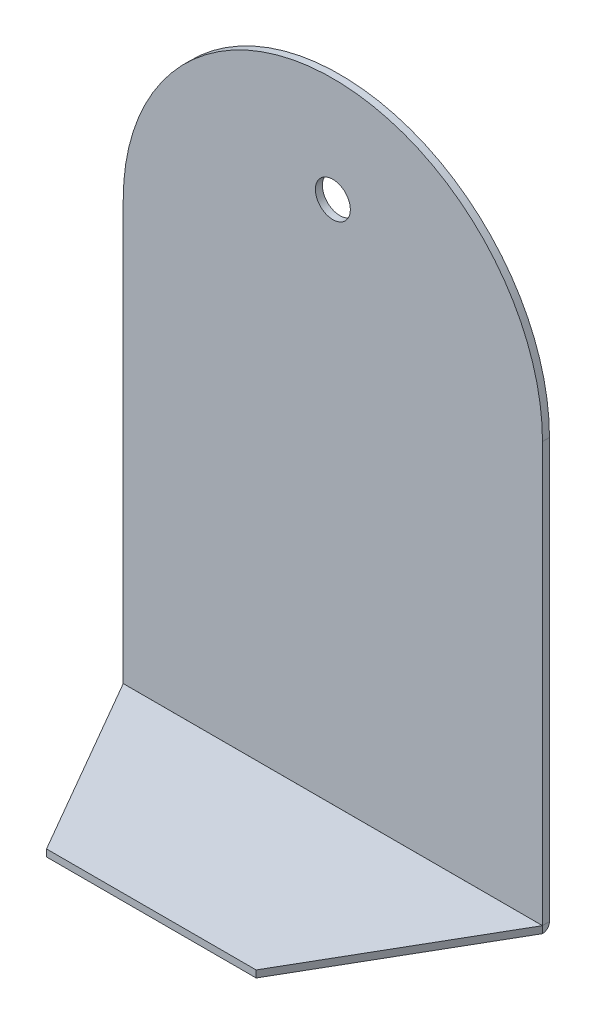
ISO-10303-21;
HEADER;
FILE_DESCRIPTION(('STEP AP214'),'2;1');
FILE_NAME('part.step','',(''),(''),'','','');
FILE_SCHEMA(('AUTOMOTIVE_DESIGN { 1 0 10303 214 1 1 1 1 }'));
ENDSEC;
DATA;
#1=APPLICATION_CONTEXT('core data for automotive mechanical design processes');
#2=APPLICATION_PROTOCOL_DEFINITION('international standard','automotive_design',2000,#1);
#3=PRODUCT_CONTEXT('',#1,'mechanical');
#4=PRODUCT('Part','Part','',(#3));
#5=PRODUCT_RELATED_PRODUCT_CATEGORY('part','',(#4));
#6=PRODUCT_DEFINITION_FORMATION('','',#4);
#7=PRODUCT_DEFINITION_CONTEXT('part definition',#1,'design');
#8=PRODUCT_DEFINITION('design','',#6,#7);
#9=PRODUCT_DEFINITION_SHAPE('','',#8);
#10=(LENGTH_UNIT() NAMED_UNIT(*) SI_UNIT(.MILLI.,.METRE.));
#11=(NAMED_UNIT(*) PLANE_ANGLE_UNIT() SI_UNIT($,.RADIAN.));
#12=(NAMED_UNIT(*) SI_UNIT($,.STERADIAN.) SOLID_ANGLE_UNIT());
#13=UNCERTAINTY_MEASURE_WITH_UNIT(LENGTH_MEASURE(1.E-05),#10,'distance_accuracy_value','');
#14=(GEOMETRIC_REPRESENTATION_CONTEXT(3) GLOBAL_UNCERTAINTY_ASSIGNED_CONTEXT((#13)) GLOBAL_UNIT_ASSIGNED_CONTEXT((#10,
#11,#12)) REPRESENTATION_CONTEXT('',''));
#15=CARTESIAN_POINT('',(0.,0.,0.));
#16=DIRECTION('',(0.,0.,1.));
#17=DIRECTION('',(1.,0.,0.));
#18=AXIS2_PLACEMENT_3D('',#15,#16,#17);
#19=CARTESIAN_POINT('',(0.,-60.0010000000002,-59.0005865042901));
#20=DIRECTION('',(0.,1.,0.));
#21=DIRECTION('',(1.,0.,0.));
#22=AXIS2_PLACEMENT_3D('',#19,#20,#21);
#23=PLANE('',#22);
#24=DIRECTION('',(0.499999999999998,0.,-0.86602540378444));
#25=VECTOR('',#24,1.);
#26=CARTESIAN_POINT('',(30.,-60.001,0.999413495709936));
#27=LINE('',#26,#25);
#28=CARTESIAN_POINT('',(15.0000000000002,-60.0009999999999,26.980175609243));
#29=VERTEX_POINT('',#28);
#30=CARTESIAN_POINT('',(29.9990840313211,-60.001,1.001));
#31=VERTEX_POINT('',#30);
#32=EDGE_CURVE('E126',#29,#31,#27,.T.);
#33=ORIENTED_EDGE('',*,*,#32,.T.);
#34=DIRECTION('',(-1.,0.,0.));
#35=VECTOR('',#34,1.);
#36=CARTESIAN_POINT('',(0.,-60.001,1.001));
#37=LINE('',#36,#35);
#38=CARTESIAN_POINT('',(-29.9990840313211,-60.001,1.00100000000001));
#39=VERTEX_POINT('',#38);
#40=EDGE_CURVE('E167',#31,#39,#37,.T.);
#41=ORIENTED_EDGE('',*,*,#40,.T.);
#42=DIRECTION('',(0.499999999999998,0.,0.86602540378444));
#43=VECTOR('',#42,1.);
#44=CARTESIAN_POINT('',(-15.0000000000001,-60.0009999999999,26.980175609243));
#45=LINE('',#44,#43);
#46=CARTESIAN_POINT('',(-15.0000000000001,-60.0009999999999,26.980175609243));
#47=VERTEX_POINT('',#46);
#48=EDGE_CURVE('E130',#39,#47,#45,.T.);
#49=ORIENTED_EDGE('',*,*,#48,.T.);
#50=DIRECTION('',(1.,0.,0.));
#51=VECTOR('',#50,1.);
#52=CARTESIAN_POINT('',(15.0000000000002,-60.0009999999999,26.980175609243));
#53=LINE('',#52,#51);
#54=EDGE_CURVE('E94',#47,#29,#53,.T.);
#55=ORIENTED_EDGE('',*,*,#54,.T.);
#56=EDGE_LOOP('',(#33,#41,#49,#55));
#57=FACE_BOUND('',#56,.T.);
#58=ADVANCED_FACE('F67',(#57),#23,.T.);
#59=CARTESIAN_POINT('',(0.,-61.0010000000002,-59.0005865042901));
#60=DIRECTION('',(0.,1.,0.));
#61=DIRECTION('',(1.,0.,0.));
#62=AXIS2_PLACEMENT_3D('',#59,#60,#61);
#63=PLANE('',#62);
#64=DIRECTION('',(-1.,0.,0.));
#65=VECTOR('',#64,1.);
#66=CARTESIAN_POINT('',(0.,-61.001,1.001));
#67=LINE('',#66,#65);
#68=CARTESIAN_POINT('',(29.9990840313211,-61.001,1.00100000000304));
#69=VERTEX_POINT('',#68);
#70=CARTESIAN_POINT('',(-29.9990840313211,-61.001,1.00100000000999));
#71=VERTEX_POINT('',#70);
#72=EDGE_CURVE('E78',#69,#71,#67,.T.);
#73=ORIENTED_EDGE('',*,*,#72,.F.);
#74=DIRECTION('',(0.499999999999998,0.,-0.86602540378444));
#75=VECTOR('',#74,1.);
#76=CARTESIAN_POINT('',(30.,-61.001,0.999413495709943));
#77=LINE('',#76,#75);
#78=CARTESIAN_POINT('',(15.0000000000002,-61.0009999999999,26.980175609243));
#79=VERTEX_POINT('',#78);
#80=EDGE_CURVE('E117',#79,#69,#77,.T.);
#81=ORIENTED_EDGE('',*,*,#80,.F.);
#82=DIRECTION('',(1.,0.,0.));
#83=VECTOR('',#82,1.);
#84=CARTESIAN_POINT('',(15.0000000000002,-61.0009999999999,26.980175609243));
#85=LINE('',#84,#83);
#86=CARTESIAN_POINT('',(-15.0000000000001,-61.0009999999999,26.980175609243));
#87=VERTEX_POINT('',#86);
#88=EDGE_CURVE('E107',#87,#79,#85,.T.);
#89=ORIENTED_EDGE('',*,*,#88,.F.);
#90=DIRECTION('',(0.499999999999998,0.,0.86602540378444));
#91=VECTOR('',#90,1.);
#92=CARTESIAN_POINT('',(-15.0000000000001,-61.0009999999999,26.980175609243));
#93=LINE('',#92,#91);
#94=EDGE_CURVE('E118',#71,#87,#93,.T.);
#95=ORIENTED_EDGE('',*,*,#94,.F.);
#96=EDGE_LOOP('',(#73,#81,#89,#95));
#97=FACE_BOUND('',#96,.T.);
#98=ADVANCED_FACE('F128',(#97),#63,.F.);
#99=CARTESIAN_POINT('',(-15.0000000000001,-60.0009999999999,26.980175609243));
#100=DIRECTION('',(0.86602540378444,0.,-0.499999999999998));
#101=DIRECTION('',(-0.499999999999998,0.,-0.86602540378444));
#102=AXIS2_PLACEMENT_3D('',#99,#100,#101);
#103=PLANE('',#102);
#104=CARTESIAN_POINT('',(-29.9990840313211,-61.001,1.00100000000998));
#105=CARTESIAN_POINT('',(-29.9990840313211,-60.001,1.00100000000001));
#106=B_SPLINE_CURVE_WITH_KNOTS('',1,(#104,#105),.UNSPECIFIED.,.F.,.F.,(2,2),(0.,1.),.UNSPECIFIED.);
#107=EDGE_CURVE('E14',#71,#39,#106,.T.);
#108=ORIENTED_EDGE('',*,*,#107,.F.);
#109=ORIENTED_EDGE('',*,*,#94,.T.);
#110=DIRECTION('',(0.,-1.,0.));
#111=VECTOR('',#110,1.);
#112=CARTESIAN_POINT('',(-15.0000000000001,-60.0009999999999,26.980175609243));
#113=LINE('',#112,#111);
#114=EDGE_CURVE('E113',#47,#87,#113,.T.);
#115=ORIENTED_EDGE('',*,*,#114,.F.);
#116=ORIENTED_EDGE('',*,*,#48,.F.);
#117=EDGE_LOOP('',(#108,#109,#115,#116));
#118=FACE_BOUND('',#117,.T.);
#119=ADVANCED_FACE('F69',(#118),#103,.F.);
#120=CARTESIAN_POINT('',(15.0000000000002,-60.0009999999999,26.980175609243));
#121=DIRECTION('',(0.,0.,-1.));
#122=DIRECTION('',(-1.,0.,0.));
#123=AXIS2_PLACEMENT_3D('',#120,#121,#122);
#124=PLANE('',#123);
#125=ORIENTED_EDGE('',*,*,#88,.T.);
#126=DIRECTION('',(0.,-1.,0.));
#127=VECTOR('',#126,1.);
#128=CARTESIAN_POINT('',(15.0000000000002,-60.0009999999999,26.980175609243));
#129=LINE('',#128,#127);
#130=EDGE_CURVE('E110',#29,#79,#129,.T.);
#131=ORIENTED_EDGE('',*,*,#130,.F.);
#132=ORIENTED_EDGE('',*,*,#54,.F.);
#133=ORIENTED_EDGE('',*,*,#114,.T.);
#134=EDGE_LOOP('',(#125,#131,#132,#133));
#135=FACE_BOUND('',#134,.T.);
#136=ADVANCED_FACE('F109',(#135),#124,.F.);
#137=CARTESIAN_POINT('',(30.,-60.001,0.999413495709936));
#138=DIRECTION('',(-0.86602540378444,0.,-0.499999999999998));
#139=DIRECTION('',(-0.499999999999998,0.,0.86602540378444));
#140=AXIS2_PLACEMENT_3D('',#137,#138,#139);
#141=PLANE('',#140);
#142=CARTESIAN_POINT('',(29.9990840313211,-60.001,1.001));
#143=CARTESIAN_POINT('',(29.9990840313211,-61.001,1.00100000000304));
#144=B_SPLINE_CURVE_WITH_KNOTS('',1,(#142,#143),.UNSPECIFIED.,.F.,.F.,(2,2),(0.,1.),.UNSPECIFIED.);
#145=EDGE_CURVE('E142',#31,#69,#144,.T.);
#146=ORIENTED_EDGE('',*,*,#145,.F.);
#147=ORIENTED_EDGE('',*,*,#32,.F.);
#148=ORIENTED_EDGE('',*,*,#130,.T.);
#149=ORIENTED_EDGE('',*,*,#80,.T.);
#150=EDGE_LOOP('',(#146,#147,#148,#149));
#151=FACE_BOUND('',#150,.T.);
#152=ADVANCED_FACE('F123',(#151),#141,.F.);
#153=CARTESIAN_POINT('',(0.,15.,1.));
#154=DIRECTION('',(0.,0.,-1.));
#155=DIRECTION('',(-1.,0.,0.));
#156=AXIS2_PLACEMENT_3D('',#153,#154,#155);
#157=CYLINDRICAL_SURFACE('',#156,2.5);
#158=CARTESIAN_POINT('',(0.,15.,1.));
#159=DIRECTION('',(0.,0.,1.));
#160=DIRECTION('',(1.,0.,0.));
#161=AXIS2_PLACEMENT_3D('',#158,#159,#160);
#162=CIRCLE('',#161,2.5);
#163=CARTESIAN_POINT('',(2.5,15.,1.));
#164=VERTEX_POINT('',#163);
#165=EDGE_CURVE('E300',#164,#164,#162,.T.);
#166=ORIENTED_EDGE('',*,*,#165,.T.);
#167=EDGE_LOOP('',(#166));
#168=FACE_BOUND('',#167,.T.);
#169=CARTESIAN_POINT('',(0.,15.,0.));
#170=DIRECTION('',(0.,0.,1.));
#171=DIRECTION('',(1.,0.,0.));
#172=AXIS2_PLACEMENT_3D('',#169,#170,#171);
#173=CIRCLE('',#172,2.5);
#174=CARTESIAN_POINT('',(2.5,15.,0.));
#175=VERTEX_POINT('',#174);
#176=EDGE_CURVE('E285',#175,#175,#173,.T.);
#177=ORIENTED_EDGE('',*,*,#176,.F.);
#178=EDGE_LOOP('',(#177));
#179=FACE_BOUND('',#178,.T.);
#180=ADVANCED_FACE('F250',(#168,#179),#157,.F.);
#181=CARTESIAN_POINT('',(0.,0.,1.));
#182=DIRECTION('',(0.,0.,-1.));
#183=DIRECTION('',(-1.,0.,0.));
#184=AXIS2_PLACEMENT_3D('',#181,#182,#183);
#185=CYLINDRICAL_SURFACE('',#184,30.);
#186=CARTESIAN_POINT('',(0.,0.,0.));
#187=DIRECTION('',(0.,0.,1.));
#188=DIRECTION('',(1.,0.,0.));
#189=AXIS2_PLACEMENT_3D('',#186,#187,#188);
#190=CIRCLE('',#189,30.);
#191=CARTESIAN_POINT('',(30.,0.,0.));
#192=VERTEX_POINT('',#191);
#193=CARTESIAN_POINT('',(-30.,0.,0.));
#194=VERTEX_POINT('',#193);
#195=EDGE_CURVE('E297',#192,#194,#190,.T.);
#196=ORIENTED_EDGE('',*,*,#195,.T.);
#197=DIRECTION('',(0.,0.,-1.));
#198=VECTOR('',#197,1.);
#199=CARTESIAN_POINT('',(-30.,0.,1.));
#200=LINE('',#199,#198);
#201=CARTESIAN_POINT('',(-30.,0.,1.));
#202=VERTEX_POINT('',#201);
#203=EDGE_CURVE('E146',#202,#194,#200,.T.);
#204=ORIENTED_EDGE('',*,*,#203,.F.);
#205=CARTESIAN_POINT('',(0.,0.,1.));
#206=DIRECTION('',(0.,0.,1.));
#207=DIRECTION('',(1.,0.,0.));
#208=AXIS2_PLACEMENT_3D('',#205,#206,#207);
#209=CIRCLE('',#208,30.);
#210=CARTESIAN_POINT('',(30.,0.,1.));
#211=VERTEX_POINT('',#210);
#212=EDGE_CURVE('E289',#211,#202,#209,.T.);
#213=ORIENTED_EDGE('',*,*,#212,.F.);
#214=DIRECTION('',(0.,0.,-1.));
#215=VECTOR('',#214,1.);
#216=CARTESIAN_POINT('',(30.,0.,1.));
#217=LINE('',#216,#215);
#218=EDGE_CURVE('E294',#211,#192,#217,.T.);
#219=ORIENTED_EDGE('',*,*,#218,.T.);
#220=EDGE_LOOP('',(#196,#204,#213,#219));
#221=FACE_BOUND('',#220,.T.);
#222=ADVANCED_FACE('F370',(#221),#185,.T.);
#223=CARTESIAN_POINT('',(0.,0.,1.));
#224=DIRECTION('',(0.,0.,1.));
#225=DIRECTION('',(1.,0.,0.));
#226=AXIS2_PLACEMENT_3D('',#223,#224,#225);
#227=PLANE('',#226);
#228=DIRECTION('',(-1.,0.,0.));
#229=VECTOR('',#228,1.);
#230=CARTESIAN_POINT('',(0.,-60.,1.));
#231=LINE('',#230,#229);
#232=CARTESIAN_POINT('',(30.,-60.,1.));
#233=VERTEX_POINT('',#232);
#234=CARTESIAN_POINT('',(-30.,-60.,1.));
#235=VERTEX_POINT('',#234);
#236=EDGE_CURVE('E319',#233,#235,#231,.T.);
#237=ORIENTED_EDGE('',*,*,#236,.F.);
#238=DIRECTION('',(0.,1.,0.));
#239=VECTOR('',#238,1.);
#240=CARTESIAN_POINT('',(30.,0.,1.));
#241=LINE('',#240,#239);
#242=EDGE_CURVE('E293',#233,#211,#241,.T.);
#243=ORIENTED_EDGE('',*,*,#242,.T.);
#244=ORIENTED_EDGE('',*,*,#212,.T.);
#245=DIRECTION('',(0.,-1.,0.));
#246=VECTOR('',#245,1.);
#247=CARTESIAN_POINT('',(-30.,-60.,1.));
#248=LINE('',#247,#246);
#249=EDGE_CURVE('E292',#202,#235,#248,.T.);
#250=ORIENTED_EDGE('',*,*,#249,.T.);
#251=EDGE_LOOP('',(#237,#243,#244,#250));
#252=FACE_BOUND('',#251,.T.);
#253=ORIENTED_EDGE('',*,*,#165,.F.);
#254=EDGE_LOOP('',(#253));
#255=FACE_BOUND('',#254,.T.);
#256=ADVANCED_FACE('F332',(#252,#255),#227,.T.);
#257=CARTESIAN_POINT('',(30.,0.,1.));
#258=DIRECTION('',(-1.,0.,0.));
#259=DIRECTION('',(0.,-1.,0.));
#260=AXIS2_PLACEMENT_3D('',#257,#258,#259);
#261=PLANE('',#260);
#262=DIRECTION('',(0.,1.,0.));
#263=VECTOR('',#262,1.);
#264=CARTESIAN_POINT('',(30.,0.,0.));
#265=LINE('',#264,#263);
#266=CARTESIAN_POINT('',(30.,-60.,0.));
#267=VERTEX_POINT('',#266);
#268=EDGE_CURVE('E306',#267,#192,#265,.T.);
#269=ORIENTED_EDGE('',*,*,#268,.T.);
#270=ORIENTED_EDGE('',*,*,#218,.F.);
#271=ORIENTED_EDGE('',*,*,#242,.F.);
#272=CARTESIAN_POINT('',(30.,-60.,0.));
#273=CARTESIAN_POINT('',(30.,-60.,1.));
#274=B_SPLINE_CURVE_WITH_KNOTS('',1,(#272,#273),.UNSPECIFIED.,.F.,.F.,(2,2),(0.,1.),.UNSPECIFIED.);
#275=EDGE_CURVE('E288',#233,#267,#274,.F.);
#276=ORIENTED_EDGE('',*,*,#275,.T.);
#277=EDGE_LOOP('',(#269,#270,#271,#276));
#278=FACE_BOUND('',#277,.T.);
#279=ADVANCED_FACE('F321',(#278),#261,.F.);
#280=CARTESIAN_POINT('',(0.,0.,0.));
#281=DIRECTION('',(0.,0.,1.));
#282=DIRECTION('',(1.,0.,0.));
#283=AXIS2_PLACEMENT_3D('',#280,#281,#282);
#284=PLANE('',#283);
#285=ORIENTED_EDGE('',*,*,#176,.T.);
#286=EDGE_LOOP('',(#285));
#287=FACE_BOUND('',#286,.T.);
#288=ORIENTED_EDGE('',*,*,#268,.F.);
#289=DIRECTION('',(-1.,0.,0.));
#290=VECTOR('',#289,1.);
#291=CARTESIAN_POINT('',(0.,-60.,0.));
#292=LINE('',#291,#290);
#293=CARTESIAN_POINT('',(-30.,-60.,0.));
#294=VERTEX_POINT('',#293);
#295=EDGE_CURVE('E202',#267,#294,#292,.T.);
#296=ORIENTED_EDGE('',*,*,#295,.T.);
#297=DIRECTION('',(0.,-1.,0.));
#298=VECTOR('',#297,1.);
#299=CARTESIAN_POINT('',(-30.,-60.,0.));
#300=LINE('',#299,#298);
#301=EDGE_CURVE('E284',#194,#294,#300,.T.);
#302=ORIENTED_EDGE('',*,*,#301,.F.);
#303=ORIENTED_EDGE('',*,*,#195,.F.);
#304=EDGE_LOOP('',(#288,#296,#302,#303));
#305=FACE_BOUND('',#304,.T.);
#306=ADVANCED_FACE('F331',(#287,#305),#284,.F.);
#307=CARTESIAN_POINT('',(-30.,-60.,1.));
#308=DIRECTION('',(1.,0.,0.));
#309=DIRECTION('',(0.,1.,0.));
#310=AXIS2_PLACEMENT_3D('',#307,#308,#309);
#311=PLANE('',#310);
#312=ORIENTED_EDGE('',*,*,#301,.T.);
#313=CARTESIAN_POINT('',(-30.,-60.,1.));
#314=CARTESIAN_POINT('',(-30.,-60.,0.));
#315=B_SPLINE_CURVE_WITH_KNOTS('',1,(#313,#314),.UNSPECIFIED.,.F.,.F.,(2,2),(0.,1.),.UNSPECIFIED.);
#316=EDGE_CURVE('E273',#235,#294,#315,.T.);
#317=ORIENTED_EDGE('',*,*,#316,.F.);
#318=ORIENTED_EDGE('',*,*,#249,.F.);
#319=ORIENTED_EDGE('',*,*,#203,.T.);
#320=EDGE_LOOP('',(#312,#317,#318,#319));
#321=FACE_BOUND('',#320,.T.);
#322=ADVANCED_FACE('F335',(#321),#311,.F.);
#323=CARTESIAN_POINT('',(29.9990840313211,-61.001,1.00100000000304));
#324=CARTESIAN_POINT('',(29.9991575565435,-61.0010000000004,0.869945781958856));
#325=CARTESIAN_POINT('',(29.9992317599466,-60.9749466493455,0.738990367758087));
#326=CARTESIAN_POINT('',(29.9993816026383,-60.874660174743,0.496877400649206));
#327=CARTESIAN_POINT('',(29.9994572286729,-60.8004665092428,0.38583873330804));
#328=CARTESIAN_POINT('',(29.9996098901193,-60.6151612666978,0.200533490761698));
#329=CARTESIAN_POINT('',(29.9996869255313,-60.5041225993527,0.126339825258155));
#330=CARTESIAN_POINT('',(29.9998424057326,-60.2620096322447,0.0260533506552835));
#331=CARTESIAN_POINT('',(29.9999208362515,-60.1310542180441,0.));
#332=CARTESIAN_POINT('',(30.,-60.,0.));
#333=CARTESIAN_POINT('',(29.9990840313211,-60.001,1.001));
#334=CARTESIAN_POINT('',(29.9991575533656,-60.001,1.00086908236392));
#335=CARTESIAN_POINT('',(29.9992317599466,-60.0009739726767,1.00073825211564));
#336=CARTESIAN_POINT('',(29.9993816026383,-60.0008737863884,1.00049638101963));
#337=CARTESIAN_POINT('',(29.9994572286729,-60.0007996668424,1.00038545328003));
#338=CARTESIAN_POINT('',(29.9996098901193,-60.00061454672,1.0002003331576));
#339=CARTESIAN_POINT('',(29.9996869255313,-60.0005036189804,1.00012621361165));
#340=CARTESIAN_POINT('',(29.9998424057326,-60.0002617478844,1.00002602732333));
#341=CARTESIAN_POINT('',(29.9999208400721,-60.0001309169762,1.));
#342=CARTESIAN_POINT('',(30.,-60.,1.));
#343=B_SPLINE_SURFACE_WITH_KNOTS('',1,3,((#323,#324,#325,#326,#327,#328,#329,#330,#331,#332),
(#333,#334,#335,#336,#337,#338,#339,#340,#341,#342)),.UNSPECIFIED.,.F.,.F.,.F.,(2,2),(4,2,2,2,
4),(0.,1.),(0.,0.25,0.5,0.75,1.),.UNSPECIFIED.);
#344=CARTESIAN_POINT('',(29.9990840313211,-61.001,1.00100000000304));
#345=CARTESIAN_POINT('',(29.9991575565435,-61.0010000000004,0.869945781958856));
#346=CARTESIAN_POINT('',(29.9992317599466,-60.9749466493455,0.738990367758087));
#347=CARTESIAN_POINT('',(29.9993816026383,-60.874660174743,0.496877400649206));
#348=CARTESIAN_POINT('',(29.9994572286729,-60.8004665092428,0.38583873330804));
#349=CARTESIAN_POINT('',(29.9996098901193,-60.6151612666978,0.200533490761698));
#350=CARTESIAN_POINT('',(29.9996869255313,-60.5041225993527,0.126339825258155));
#351=CARTESIAN_POINT('',(29.9998424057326,-60.2620096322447,0.0260533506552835));
#352=CARTESIAN_POINT('',(29.9999208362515,-60.1310542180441,0.));
#353=CARTESIAN_POINT('',(30.,-60.,0.));
#354=B_SPLINE_CURVE_WITH_KNOTS('',3,(#344,#345,#346,#347,#348,#349,#350,#351,#352,#353),
.UNSPECIFIED.,.F.,.F.,(4,2,2,2,4),(0.,0.25,0.5,0.75,1.),.UNSPECIFIED.);
#355=EDGE_CURVE('E191',#69,#267,#354,.T.);
#356=CARTESIAN_POINT('',(30.,-60.,1.));
#357=CARTESIAN_POINT('',(29.9999208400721,-60.0001309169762,1.));
#358=CARTESIAN_POINT('',(29.9998424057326,-60.0002617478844,1.00002602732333));
#359=CARTESIAN_POINT('',(29.9996869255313,-60.0005036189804,1.00012621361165));
#360=CARTESIAN_POINT('',(29.9996098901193,-60.00061454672,1.0002003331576));
#361=CARTESIAN_POINT('',(29.9994572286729,-60.0007996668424,1.00038545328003));
#362=CARTESIAN_POINT('',(29.9993816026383,-60.0008737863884,1.00049638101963));
#363=CARTESIAN_POINT('',(29.9992317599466,-60.0009739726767,1.00073825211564));
#364=CARTESIAN_POINT('',(29.9991575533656,-60.001,1.00086908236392));
#365=CARTESIAN_POINT('',(29.9990840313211,-60.001,1.001));
#366=B_SPLINE_CURVE_WITH_KNOTS('',3,(#356,#357,#358,#359,#360,#361,#362,#363,#364,#365),
.UNSPECIFIED.,.F.,.F.,(4,2,2,2,4),(0.,0.25,0.5,0.75,1.),.UNSPECIFIED.);
#367=EDGE_CURVE('E194',#31,#233,#366,.F.);
#368=ORIENTED_EDGE('',*,*,#145,.T.);
#369=ORIENTED_EDGE('',*,*,#355,.T.);
#370=ORIENTED_EDGE('',*,*,#275,.F.);
#371=ORIENTED_EDGE('',*,*,#367,.F.);
#372=EDGE_LOOP('',(#368,#369,#370,#371));
#373=FACE_BOUND('',#372,.T.);
#374=ADVANCED_FACE('F188',(#373),#343,.F.);
#375=CARTESIAN_POINT('',(-30.,-60.,0.));
#376=CARTESIAN_POINT('',(-29.9999264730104,-60.1310542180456,0.));
#377=CARTESIAN_POINT('',(-29.9998522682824,-60.2620096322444,0.0260533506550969));
#378=CARTESIAN_POINT('',(-29.9997024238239,-60.5041225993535,0.126339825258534));
#379=CARTESIAN_POINT('',(-29.9996267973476,-60.6151612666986,0.200533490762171));
#380=CARTESIAN_POINT('',(-29.9994741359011,-60.8004665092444,0.385838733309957));
#381=CARTESIAN_POINT('',(-29.9993971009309,-60.8746601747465,0.496877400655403));
#382=CARTESIAN_POINT('',(-29.9992416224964,-60.9749466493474,0.738990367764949));
#383=CARTESIAN_POINT('',(-29.9991631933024,-61.0010000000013,0.869945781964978));
#384=CARTESIAN_POINT('',(-29.9990840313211,-61.001,1.00100000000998));
#385=CARTESIAN_POINT('',(-30.,-60.,1.));
#386=CARTESIAN_POINT('',(-29.9999264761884,-60.0001309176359,1.));
#387=CARTESIAN_POINT('',(-29.9998522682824,-60.0002617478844,1.00002602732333));
#388=CARTESIAN_POINT('',(-29.9997024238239,-60.0005036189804,1.00012621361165));
#389=CARTESIAN_POINT('',(-29.9996267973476,-60.00061454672,1.0002003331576));
#390=CARTESIAN_POINT('',(-29.9994741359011,-60.0007996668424,1.00038545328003));
#391=CARTESIAN_POINT('',(-29.9993971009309,-60.0008737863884,1.00049638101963));
#392=CARTESIAN_POINT('',(-29.9992416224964,-60.0009739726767,1.00073825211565));
#393=CARTESIAN_POINT('',(-29.999163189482,-60.001,1.00086908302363));
#394=CARTESIAN_POINT('',(-29.9990840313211,-60.001,1.00100000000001));
#395=B_SPLINE_SURFACE_WITH_KNOTS('',1,3,((#375,#376,#377,#378,#379,#380,#381,#382,#383,#384),
(#385,#386,#387,#388,#389,#390,#391,#392,#393,#394)),.UNSPECIFIED.,.F.,.F.,.F.,(2,2),(4,2,2,2,
4),(0.,1.),(0.,0.25,0.5,0.75,1.),.UNSPECIFIED.);
#396=CARTESIAN_POINT('',(-30.,-60.,0.));
#397=CARTESIAN_POINT('',(-29.9999264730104,-60.1310542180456,0.));
#398=CARTESIAN_POINT('',(-29.9998522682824,-60.2620096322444,0.0260533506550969));
#399=CARTESIAN_POINT('',(-29.9997024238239,-60.5041225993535,0.126339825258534));
#400=CARTESIAN_POINT('',(-29.9996267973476,-60.6151612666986,0.200533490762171));
#401=CARTESIAN_POINT('',(-29.9994741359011,-60.8004665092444,0.385838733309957));
#402=CARTESIAN_POINT('',(-29.9993971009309,-60.8746601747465,0.496877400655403));
#403=CARTESIAN_POINT('',(-29.9992416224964,-60.9749466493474,0.738990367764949));
#404=CARTESIAN_POINT('',(-29.9991631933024,-61.0010000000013,0.869945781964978));
#405=CARTESIAN_POINT('',(-29.9990840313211,-61.001,1.00100000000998));
#406=B_SPLINE_CURVE_WITH_KNOTS('',3,(#396,#397,#398,#399,#400,#401,#402,#403,#404,#405),
.UNSPECIFIED.,.F.,.F.,(4,2,2,2,4),(0.,0.25,0.5,0.75,1.),.UNSPECIFIED.);
#407=EDGE_CURVE('E163',#294,#71,#406,.T.);
#408=CARTESIAN_POINT('',(-29.9990840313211,-60.001,1.00100000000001));
#409=CARTESIAN_POINT('',(-29.999163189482,-60.001,1.00086908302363));
#410=CARTESIAN_POINT('',(-29.9992416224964,-60.0009739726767,1.00073825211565));
#411=CARTESIAN_POINT('',(-29.9993971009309,-60.0008737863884,1.00049638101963));
#412=CARTESIAN_POINT('',(-29.9994741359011,-60.0007996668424,1.00038545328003));
#413=CARTESIAN_POINT('',(-29.9996267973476,-60.00061454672,1.0002003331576));
#414=CARTESIAN_POINT('',(-29.9997024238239,-60.0005036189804,1.00012621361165));
#415=CARTESIAN_POINT('',(-29.9998522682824,-60.0002617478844,1.00002602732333));
#416=CARTESIAN_POINT('',(-29.9999264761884,-60.0001309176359,1.));
#417=CARTESIAN_POINT('',(-30.,-60.,1.));
#418=B_SPLINE_CURVE_WITH_KNOTS('',3,(#408,#409,#410,#411,#412,#413,#414,#415,#416,#417),
.UNSPECIFIED.,.F.,.F.,(4,2,2,2,4),(0.,0.25,0.5,0.75,1.),.UNSPECIFIED.);
#419=EDGE_CURVE('E85',#235,#39,#418,.F.);
#420=ORIENTED_EDGE('',*,*,#407,.T.);
#421=ORIENTED_EDGE('',*,*,#107,.T.);
#422=ORIENTED_EDGE('',*,*,#419,.F.);
#423=ORIENTED_EDGE('',*,*,#316,.T.);
#424=EDGE_LOOP('',(#420,#421,#422,#423));
#425=FACE_BOUND('',#424,.T.);
#426=ADVANCED_FACE('F157',(#425),#395,.F.);
#427=CARTESIAN_POINT('',(-60.008332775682,-60.,1.001));
#428=DIRECTION('',(1.,0.,0.));
#429=DIRECTION('',(0.,0.,-1.));
#430=AXIS2_PLACEMENT_3D('',#427,#428,#429);
#431=CYLINDRICAL_SURFACE('',#430,0.001);
#432=ORIENTED_EDGE('',*,*,#236,.T.);
#433=ORIENTED_EDGE('',*,*,#419,.T.);
#434=ORIENTED_EDGE('',*,*,#40,.F.);
#435=ORIENTED_EDGE('',*,*,#367,.T.);
#436=EDGE_LOOP('',(#432,#433,#434,#435));
#437=FACE_BOUND('',#436,.T.);
#438=ADVANCED_FACE('F220',(#437),#431,.F.);
#439=CARTESIAN_POINT('',(-60.008332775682,-60.,1.001));
#440=DIRECTION('',(1.,0.,0.));
#441=DIRECTION('',(0.,0.,-1.));
#442=AXIS2_PLACEMENT_3D('',#439,#440,#441);
#443=CYLINDRICAL_SURFACE('',#442,1.001);
#444=ORIENTED_EDGE('',*,*,#295,.F.);
#445=ORIENTED_EDGE('',*,*,#355,.F.);
#446=ORIENTED_EDGE('',*,*,#72,.T.);
#447=ORIENTED_EDGE('',*,*,#407,.F.);
#448=EDGE_LOOP('',(#444,#445,#446,#447));
#449=FACE_BOUND('',#448,.T.);
#450=ADVANCED_FACE('F200',(#449),#443,.T.);
#451=CLOSED_SHELL('',(#58,#98,#119,#136,#152,#180,#222,#256,#279,#306,#322,#374,#426,#438,#450));
#452=MANIFOLD_SOLID_BREP('B2',#451);
#453=ADVANCED_BREP_SHAPE_REPRESENTATION('',(#18,#452),#14);
#454=SHAPE_DEFINITION_REPRESENTATION(#9,#453);
ENDSEC;
END-ISO-10303-21;
